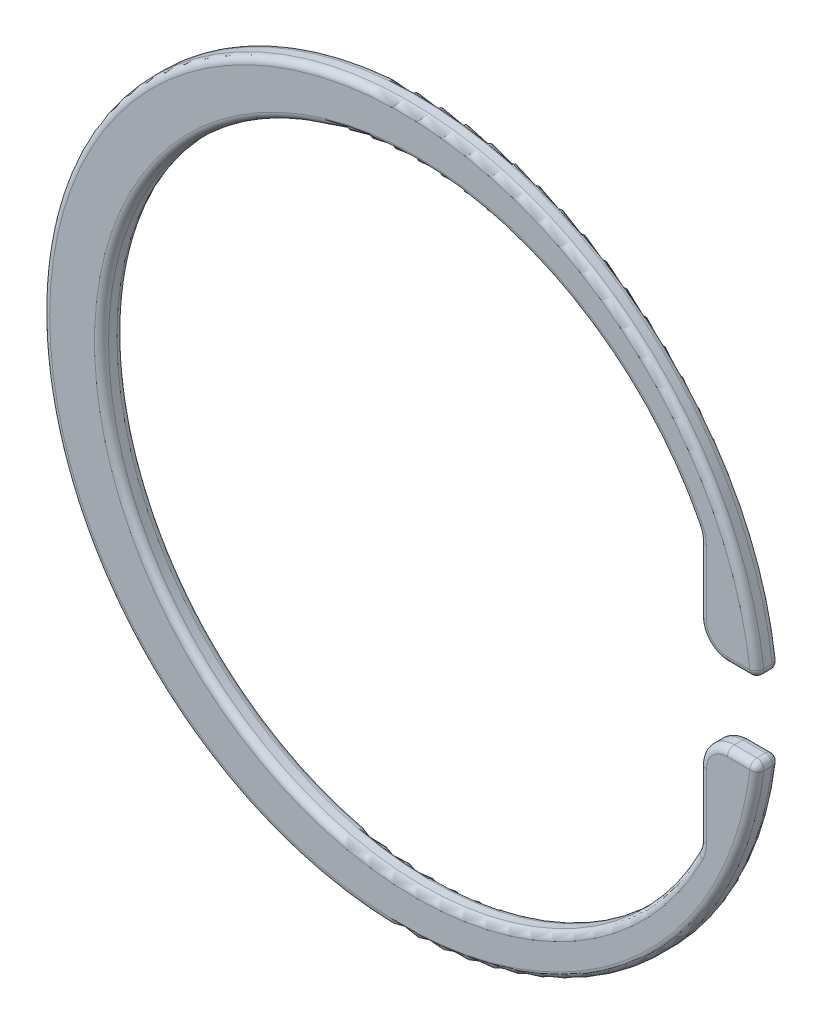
ISO-10303-21;
HEADER;
FILE_DESCRIPTION(('STEP AP214'),'2;1');
FILE_NAME('part.step','',(''),(''),'','','');
FILE_SCHEMA(('AUTOMOTIVE_DESIGN { 1 0 10303 214 1 1 1 1 }'));
ENDSEC;
DATA;
#1=APPLICATION_CONTEXT('core data for automotive mechanical design processes');
#2=APPLICATION_PROTOCOL_DEFINITION('international standard','automotive_design',2000,#1);
#3=PRODUCT_CONTEXT('',#1,'mechanical');
#4=PRODUCT('Part','Part','',(#3));
#5=PRODUCT_RELATED_PRODUCT_CATEGORY('part','',(#4));
#6=PRODUCT_DEFINITION_FORMATION('','',#4);
#7=PRODUCT_DEFINITION_CONTEXT('part definition',#1,'design');
#8=PRODUCT_DEFINITION('design','',#6,#7);
#9=PRODUCT_DEFINITION_SHAPE('','',#8);
#10=(LENGTH_UNIT() NAMED_UNIT(*) SI_UNIT(.MILLI.,.METRE.));
#11=(NAMED_UNIT(*) PLANE_ANGLE_UNIT() SI_UNIT($,.RADIAN.));
#12=(NAMED_UNIT(*) SI_UNIT($,.STERADIAN.) SOLID_ANGLE_UNIT());
#13=UNCERTAINTY_MEASURE_WITH_UNIT(LENGTH_MEASURE(1.E-05),#10,'distance_accuracy_value','');
#14=(GEOMETRIC_REPRESENTATION_CONTEXT(3) GLOBAL_UNCERTAINTY_ASSIGNED_CONTEXT((#13)) GLOBAL_UNIT_ASSIGNED_CONTEXT((#10,
#11,#12)) REPRESENTATION_CONTEXT('',''));
#15=CARTESIAN_POINT('',(0.,0.,0.));
#16=DIRECTION('',(0.,0.,1.));
#17=DIRECTION('',(1.,0.,0.));
#18=AXIS2_PLACEMENT_3D('',#15,#16,#17);
#19=CARTESIAN_POINT('',(4.9022,-2.34369201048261,0.4064));
#20=DIRECTION('',(0.,0.,-1.));
#21=DIRECTION('',(-1.,0.,0.));
#22=AXIS2_PLACEMENT_3D('',#19,#20,#21);
#23=CYLINDRICAL_SURFACE('',#22,0.508000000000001);
#24=DIRECTION('',(0.,0.,-1.));
#25=VECTOR('',#24,1.);
#26=CARTESIAN_POINT('',(5.41020000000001,-2.34369201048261,0.4064));
#27=LINE('',#26,#25);
#28=CARTESIAN_POINT('',(5.41020000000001,-2.34369201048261,0.2794));
#29=VERTEX_POINT('',#28);
#30=CARTESIAN_POINT('',(5.41020000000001,-2.34369201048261,0.127));
#31=VERTEX_POINT('',#30);
#32=EDGE_CURVE('E376',#29,#31,#27,.T.);
#33=ORIENTED_EDGE('',*,*,#32,.T.);
#34=CARTESIAN_POINT('',(4.9022,-2.34369201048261,0.127));
#35=DIRECTION('',(0.,0.,1.));
#36=DIRECTION('',(1.,0.,0.));
#37=AXIS2_PLACEMENT_3D('',#34,#35,#36);
#38=CIRCLE('',#37,0.508000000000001);
#39=CARTESIAN_POINT('',(5.35554963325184,-2.57290394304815,0.127));
#40=VERTEX_POINT('',#39);
#41=EDGE_CURVE('E270',#31,#40,#38,.F.);
#42=ORIENTED_EDGE('',*,*,#41,.T.);
#43=DIRECTION('',(0.,0.,-1.));
#44=VECTOR('',#43,1.);
#45=CARTESIAN_POINT('',(5.35554963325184,-2.57290394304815,0.4064));
#46=LINE('',#45,#44);
#47=CARTESIAN_POINT('',(5.35554963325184,-2.57290394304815,0.2794));
#48=VERTEX_POINT('',#47);
#49=EDGE_CURVE('E396',#48,#40,#46,.T.);
#50=ORIENTED_EDGE('',*,*,#49,.F.);
#51=CARTESIAN_POINT('',(4.9022,-2.34369201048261,0.2794));
#52=DIRECTION('',(0.,0.,1.));
#53=DIRECTION('',(1.,0.,0.));
#54=AXIS2_PLACEMENT_3D('',#51,#52,#53);
#55=CIRCLE('',#54,0.508000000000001);
#56=EDGE_CURVE('E268',#48,#29,#55,.T.);
#57=ORIENTED_EDGE('',*,*,#56,.T.);
#58=EDGE_LOOP('',(#33,#42,#50,#57));
#59=FACE_BOUND('',#58,.T.);
#60=ADVANCED_FACE('F35',(#59),#23,.F.);
#61=CARTESIAN_POINT('',(0.2667,0.,0.4064));
#62=DIRECTION('',(0.,0.,-1.));
#63=DIRECTION('',(-1.,0.,0.));
#64=AXIS2_PLACEMENT_3D('',#61,#62,#63);
#65=CYLINDRICAL_SURFACE('',#64,5.7023);
#66=ORIENTED_EDGE('',*,*,#49,.T.);
#67=CARTESIAN_POINT('',(0.2667,0.,0.127));
#68=DIRECTION('',(0.,0.,1.));
#69=DIRECTION('',(1.,0.,0.));
#70=AXIS2_PLACEMENT_3D('',#67,#68,#69);
#71=CIRCLE('',#70,5.7023);
#72=CARTESIAN_POINT('',(5.35554963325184,2.57290394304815,0.127));
#73=VERTEX_POINT('',#72);
#74=EDGE_CURVE('E266',#40,#73,#71,.F.);
#75=ORIENTED_EDGE('',*,*,#74,.T.);
#76=DIRECTION('',(0.,0.,-1.));
#77=VECTOR('',#76,1.);
#78=CARTESIAN_POINT('',(5.35554963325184,2.57290394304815,0.4064));
#79=LINE('',#78,#77);
#80=CARTESIAN_POINT('',(5.35554963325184,2.57290394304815,0.2794));
#81=VERTEX_POINT('',#80);
#82=EDGE_CURVE('E388',#81,#73,#79,.T.);
#83=ORIENTED_EDGE('',*,*,#82,.F.);
#84=CARTESIAN_POINT('',(0.2667,0.,0.2794));
#85=DIRECTION('',(0.,0.,1.));
#86=DIRECTION('',(1.,0.,0.));
#87=AXIS2_PLACEMENT_3D('',#84,#85,#86);
#88=CIRCLE('',#87,5.7023);
#89=EDGE_CURVE('E264',#81,#48,#88,.T.);
#90=ORIENTED_EDGE('',*,*,#89,.T.);
#91=EDGE_LOOP('',(#66,#75,#83,#90));
#92=FACE_BOUND('',#91,.T.);
#93=ADVANCED_FACE('F499',(#92),#65,.F.);
#94=CARTESIAN_POINT('',(4.9022,2.34369201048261,0.4064));
#95=DIRECTION('',(0.,0.,-1.));
#96=DIRECTION('',(-1.,0.,0.));
#97=AXIS2_PLACEMENT_3D('',#94,#95,#96);
#98=CYLINDRICAL_SURFACE('',#97,0.508000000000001);
#99=ORIENTED_EDGE('',*,*,#82,.T.);
#100=CARTESIAN_POINT('',(4.9022,2.34369201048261,0.127));
#101=DIRECTION('',(0.,0.,1.));
#102=DIRECTION('',(1.,0.,0.));
#103=AXIS2_PLACEMENT_3D('',#100,#101,#102);
#104=CIRCLE('',#103,0.508000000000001);
#105=CARTESIAN_POINT('',(5.4102,2.34369201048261,0.127));
#106=VERTEX_POINT('',#105);
#107=EDGE_CURVE('E262',#73,#106,#104,.F.);
#108=ORIENTED_EDGE('',*,*,#107,.T.);
#109=DIRECTION('',(0.,0.,-1.));
#110=VECTOR('',#109,1.);
#111=CARTESIAN_POINT('',(5.4102,2.34369201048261,0.4064));
#112=LINE('',#111,#110);
#113=CARTESIAN_POINT('',(5.4102,2.34369201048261,0.2794));
#114=VERTEX_POINT('',#113);
#115=EDGE_CURVE('E382',#114,#106,#112,.T.);
#116=ORIENTED_EDGE('',*,*,#115,.F.);
#117=CARTESIAN_POINT('',(4.9022,2.34369201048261,0.2794));
#118=DIRECTION('',(0.,0.,1.));
#119=DIRECTION('',(1.,0.,0.));
#120=AXIS2_PLACEMENT_3D('',#117,#118,#119);
#121=CIRCLE('',#120,0.508000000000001);
#122=EDGE_CURVE('E260',#114,#81,#121,.T.);
#123=ORIENTED_EDGE('',*,*,#122,.T.);
#124=EDGE_LOOP('',(#99,#108,#116,#123));
#125=FACE_BOUND('',#124,.T.);
#126=ADVANCED_FACE('F495',(#125),#98,.F.);
#127=CARTESIAN_POINT('',(5.4102,0.6604,0.4064));
#128=DIRECTION('',(-1.,0.,0.));
#129=DIRECTION('',(0.,0.,1.));
#130=AXIS2_PLACEMENT_3D('',#127,#128,#129);
#131=PLANE('',#130);
#132=ORIENTED_EDGE('',*,*,#115,.T.);
#133=DIRECTION('',(0.,1.,0.));
#134=VECTOR('',#133,1.);
#135=CARTESIAN_POINT('',(5.4102,1.1684,0.127));
#136=LINE('',#135,#134);
#137=CARTESIAN_POINT('',(5.4102,1.1684,0.127));
#138=VERTEX_POINT('',#137);
#139=EDGE_CURVE('E258',#106,#138,#136,.F.);
#140=ORIENTED_EDGE('',*,*,#139,.T.);
#141=DIRECTION('',(0.,0.,-1.));
#142=VECTOR('',#141,1.);
#143=CARTESIAN_POINT('',(5.4102,1.1684,0.4064));
#144=LINE('',#143,#142);
#145=CARTESIAN_POINT('',(5.4102,1.1684,0.2794));
#146=VERTEX_POINT('',#145);
#147=EDGE_CURVE('E395',#138,#146,#144,.F.);
#148=ORIENTED_EDGE('',*,*,#147,.T.);
#149=DIRECTION('',(0.,1.,0.));
#150=VECTOR('',#149,1.);
#151=CARTESIAN_POINT('',(5.4102,0.6604,0.2794));
#152=LINE('',#151,#150);
#153=EDGE_CURVE('E256',#146,#114,#152,.T.);
#154=ORIENTED_EDGE('',*,*,#153,.T.);
#155=EDGE_LOOP('',(#132,#140,#148,#154));
#156=FACE_BOUND('',#155,.T.);
#157=ADVANCED_FACE('F482',(#156),#131,.T.);
#158=CARTESIAN_POINT('',(6.46877713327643,0.6604,0.4064));
#159=DIRECTION('',(0.,-1.,0.));
#160=DIRECTION('',(0.,0.,-1.));
#161=AXIS2_PLACEMENT_3D('',#158,#159,#160);
#162=PLANE('',#161);
#163=DIRECTION('',(0.,0.,-1.));
#164=VECTOR('',#163,1.);
#165=CARTESIAN_POINT('',(5.9182,0.6604,0.4064));
#166=LINE('',#165,#164);
#167=CARTESIAN_POINT('',(5.9182,0.6604,0.2794));
#168=VERTEX_POINT('',#167);
#169=CARTESIAN_POINT('',(5.9182,0.6604,0.127));
#170=VERTEX_POINT('',#169);
#171=EDGE_CURVE('E392',#168,#170,#166,.T.);
#172=ORIENTED_EDGE('',*,*,#171,.T.);
#173=DIRECTION('',(-1.,0.,0.));
#174=VECTOR('',#173,1.);
#175=CARTESIAN_POINT('',(6.46877713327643,0.6604,0.127));
#176=LINE('',#175,#174);
#177=CARTESIAN_POINT('',(6.32658884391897,0.6604,0.127));
#178=VERTEX_POINT('',#177);
#179=EDGE_CURVE('E249',#170,#178,#176,.F.);
#180=ORIENTED_EDGE('',*,*,#179,.T.);
#181=DIRECTION('',(0.,0.,-1.));
#182=VECTOR('',#181,1.);
#183=CARTESIAN_POINT('',(6.32658884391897,0.6604,0.4064));
#184=LINE('',#183,#182);
#185=CARTESIAN_POINT('',(6.32658884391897,0.6604,0.2794));
#186=VERTEX_POINT('',#185);
#187=EDGE_CURVE('E247',#178,#186,#184,.F.);
#188=ORIENTED_EDGE('',*,*,#187,.T.);
#189=DIRECTION('',(-1.,0.,0.));
#190=VECTOR('',#189,1.);
#191=CARTESIAN_POINT('',(6.46877713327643,0.6604,0.2794));
#192=LINE('',#191,#190);
#193=EDGE_CURVE('E245',#186,#168,#192,.T.);
#194=ORIENTED_EDGE('',*,*,#193,.T.);
#195=EDGE_LOOP('',(#172,#180,#188,#194));
#196=FACE_BOUND('',#195,.T.);
#197=ADVANCED_FACE('F462',(#196),#162,.T.);
#198=CARTESIAN_POINT('',(0.,0.,0.4064));
#199=DIRECTION('',(0.,0.,-1.));
#200=DIRECTION('',(-1.,0.,0.));
#201=AXIS2_PLACEMENT_3D('',#198,#199,#200);
#202=CYLINDRICAL_SURFACE('',#201,6.5024);
#203=DIRECTION('',(0.,0.,-1.));
#204=VECTOR('',#203,1.);
#205=CARTESIAN_POINT('',(6.4526165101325,0.803085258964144,0.4064));
#206=LINE('',#205,#204);
#207=CARTESIAN_POINT('',(6.4526165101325,0.803085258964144,0.2794));
#208=VERTEX_POINT('',#207);
#209=CARTESIAN_POINT('',(6.4526165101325,0.803085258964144,0.127));
#210=VERTEX_POINT('',#209);
#211=EDGE_CURVE('E287',#208,#210,#206,.T.);
#212=ORIENTED_EDGE('',*,*,#211,.T.);
#213=CARTESIAN_POINT('',(0.,0.,0.127));
#214=DIRECTION('',(0.,0.,1.));
#215=DIRECTION('',(1.,0.,0.));
#216=AXIS2_PLACEMENT_3D('',#213,#214,#215);
#217=CIRCLE('',#216,6.5024);
#218=CARTESIAN_POINT('',(6.4526165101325,-0.803085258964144,0.127));
#219=VERTEX_POINT('',#218);
#220=EDGE_CURVE('E291',#210,#219,#217,.T.);
#221=ORIENTED_EDGE('',*,*,#220,.T.);
#222=DIRECTION('',(0.,0.,-1.));
#223=VECTOR('',#222,1.);
#224=CARTESIAN_POINT('',(6.4526165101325,-0.803085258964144,0.4064));
#225=LINE('',#224,#223);
#226=CARTESIAN_POINT('',(6.4526165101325,-0.803085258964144,0.2794));
#227=VERTEX_POINT('',#226);
#228=EDGE_CURVE('E289',#219,#227,#225,.F.);
#229=ORIENTED_EDGE('',*,*,#228,.T.);
#230=CARTESIAN_POINT('',(0.,0.,0.2794));
#231=DIRECTION('',(0.,0.,1.));
#232=DIRECTION('',(1.,0.,0.));
#233=AXIS2_PLACEMENT_3D('',#230,#231,#232);
#234=CIRCLE('',#233,6.5024);
#235=EDGE_CURVE('E285',#227,#208,#234,.F.);
#236=ORIENTED_EDGE('',*,*,#235,.T.);
#237=EDGE_LOOP('',(#212,#221,#229,#236));
#238=FACE_BOUND('',#237,.T.);
#239=ADVANCED_FACE('F432',(#238),#202,.T.);
#240=CARTESIAN_POINT('',(5.4102,-0.6604,0.4064));
#241=DIRECTION('',(0.,1.,0.));
#242=DIRECTION('',(0.,0.,1.));
#243=AXIS2_PLACEMENT_3D('',#240,#241,#242);
#244=PLANE('',#243);
#245=DIRECTION('',(0.,0.,-1.));
#246=VECTOR('',#245,1.);
#247=CARTESIAN_POINT('',(6.32658884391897,-0.6604,0.4064));
#248=LINE('',#247,#246);
#249=CARTESIAN_POINT('',(6.32658884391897,-0.6604,0.2794));
#250=VERTEX_POINT('',#249);
#251=CARTESIAN_POINT('',(6.32658884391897,-0.6604,0.127));
#252=VERTEX_POINT('',#251);
#253=EDGE_CURVE('E274',#250,#252,#248,.T.);
#254=ORIENTED_EDGE('',*,*,#253,.T.);
#255=DIRECTION('',(1.,0.,0.));
#256=VECTOR('',#255,1.);
#257=CARTESIAN_POINT('',(5.9182,-0.6604,0.127));
#258=LINE('',#257,#256);
#259=CARTESIAN_POINT('',(5.9182,-0.6604,0.127));
#260=VERTEX_POINT('',#259);
#261=EDGE_CURVE('E205',#252,#260,#258,.F.);
#262=ORIENTED_EDGE('',*,*,#261,.T.);
#263=DIRECTION('',(0.,0.,-1.));
#264=VECTOR('',#263,1.);
#265=CARTESIAN_POINT('',(5.9182,-0.6604,0.4064));
#266=LINE('',#265,#264);
#267=CARTESIAN_POINT('',(5.9182,-0.6604,0.2794));
#268=VERTEX_POINT('',#267);
#269=EDGE_CURVE('E224',#260,#268,#266,.F.);
#270=ORIENTED_EDGE('',*,*,#269,.T.);
#271=DIRECTION('',(1.,0.,0.));
#272=VECTOR('',#271,1.);
#273=CARTESIAN_POINT('',(5.4102,-0.6604,0.2794));
#274=LINE('',#273,#272);
#275=EDGE_CURVE('E272',#268,#250,#274,.T.);
#276=ORIENTED_EDGE('',*,*,#275,.T.);
#277=EDGE_LOOP('',(#254,#262,#270,#276));
#278=FACE_BOUND('',#277,.T.);
#279=ADVANCED_FACE('F418',(#278),#244,.T.);
#280=CARTESIAN_POINT('',(5.41020000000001,-2.34369201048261,0.4064));
#281=DIRECTION('',(-1.,0.,0.));
#282=DIRECTION('',(0.,-1.,0.));
#283=AXIS2_PLACEMENT_3D('',#280,#281,#282);
#284=PLANE('',#283);
#285=DIRECTION('',(0.,0.,-1.));
#286=VECTOR('',#285,1.);
#287=CARTESIAN_POINT('',(5.4102,-1.1684,0.4064));
#288=LINE('',#287,#286);
#289=CARTESIAN_POINT('',(5.4102,-1.1684,0.2794));
#290=VERTEX_POINT('',#289);
#291=CARTESIAN_POINT('',(5.4102,-1.1684,0.127));
#292=VERTEX_POINT('',#291);
#293=EDGE_CURVE('E227',#290,#292,#288,.T.);
#294=ORIENTED_EDGE('',*,*,#293,.T.);
#295=DIRECTION('',(0.,1.,0.));
#296=VECTOR('',#295,1.);
#297=CARTESIAN_POINT('',(5.41020000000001,-2.34369201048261,0.127));
#298=LINE('',#297,#296);
#299=EDGE_CURVE('E279',#292,#31,#298,.F.);
#300=ORIENTED_EDGE('',*,*,#299,.T.);
#301=ORIENTED_EDGE('',*,*,#32,.F.);
#302=DIRECTION('',(0.,1.,0.));
#303=VECTOR('',#302,1.);
#304=CARTESIAN_POINT('',(5.41020000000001,-2.34369201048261,0.2794));
#305=LINE('',#304,#303);
#306=EDGE_CURVE('E277',#29,#290,#305,.T.);
#307=ORIENTED_EDGE('',*,*,#306,.T.);
#308=EDGE_LOOP('',(#294,#300,#301,#307));
#309=FACE_BOUND('',#308,.T.);
#310=ADVANCED_FACE('F402',(#309),#284,.T.);
#311=CARTESIAN_POINT('',(4.9022,-2.34369201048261,0.4064));
#312=DIRECTION('',(0.,0.,1.));
#313=DIRECTION('',(1.,0.,0.));
#314=AXIS2_PLACEMENT_3D('',#311,#312,#313);
#315=PLANE('',#314);
#316=DIRECTION('',(-1.,0.,0.));
#317=VECTOR('',#316,1.);
#318=CARTESIAN_POINT('',(4.9022,0.7874,0.4064));
#319=LINE('',#318,#317);
#320=CARTESIAN_POINT('',(5.9182,0.7874,0.4064));
#321=VERTEX_POINT('',#320);
#322=CARTESIAN_POINT('',(6.32658884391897,0.7874,0.4064));
#323=VERTEX_POINT('',#322);
#324=EDGE_CURVE('E300',#321,#323,#319,.F.);
#325=ORIENTED_EDGE('',*,*,#324,.T.);
#326=CARTESIAN_POINT('',(0.,0.,0.4064));
#327=DIRECTION('',(0.,0.,1.));
#328=DIRECTION('',(1.,0.,0.));
#329=AXIS2_PLACEMENT_3D('',#326,#327,#328);
#330=CIRCLE('',#329,6.3754);
#331=CARTESIAN_POINT('',(6.32658884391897,-0.7874,0.4064));
#332=VERTEX_POINT('',#331);
#333=EDGE_CURVE('E11',#323,#332,#330,.T.);
#334=ORIENTED_EDGE('',*,*,#333,.T.);
#335=DIRECTION('',(1.,0.,0.));
#336=VECTOR('',#335,1.);
#337=CARTESIAN_POINT('',(4.9022,-0.7874,0.4064));
#338=LINE('',#337,#336);
#339=CARTESIAN_POINT('',(5.9182,-0.7874,0.4064));
#340=VERTEX_POINT('',#339);
#341=EDGE_CURVE('E44',#332,#340,#338,.F.);
#342=ORIENTED_EDGE('',*,*,#341,.T.);
#343=CARTESIAN_POINT('',(5.9182,-1.1684,0.4064));
#344=DIRECTION('',(0.,0.,1.));
#345=DIRECTION('',(1.,0.,0.));
#346=AXIS2_PLACEMENT_3D('',#343,#344,#345);
#347=CIRCLE('',#346,0.381);
#348=CARTESIAN_POINT('',(5.5372,-1.1684,0.4064));
#349=VERTEX_POINT('',#348);
#350=EDGE_CURVE('E308',#340,#349,#347,.T.);
#351=ORIENTED_EDGE('',*,*,#350,.T.);
#352=DIRECTION('',(0.,1.,0.));
#353=VECTOR('',#352,1.);
#354=CARTESIAN_POINT('',(5.5372,-2.34369201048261,0.4064));
#355=LINE('',#354,#353);
#356=CARTESIAN_POINT('',(5.5372,-2.34369201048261,0.4064));
#357=VERTEX_POINT('',#356);
#358=EDGE_CURVE('E306',#349,#357,#355,.F.);
#359=ORIENTED_EDGE('',*,*,#358,.T.);
#360=CARTESIAN_POINT('',(4.9022,-2.34369201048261,0.4064));
#361=DIRECTION('',(0.,0.,1.));
#362=DIRECTION('',(1.,0.,0.));
#363=AXIS2_PLACEMENT_3D('',#360,#361,#362);
#364=CIRCLE('',#363,0.635000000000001);
#365=CARTESIAN_POINT('',(5.46888704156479,-2.63020692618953,0.4064));
#366=VERTEX_POINT('',#365);
#367=EDGE_CURVE('E304',#357,#366,#364,.F.);
#368=ORIENTED_EDGE('',*,*,#367,.T.);
#369=CARTESIAN_POINT('',(0.2667,0.,0.4064));
#370=DIRECTION('',(0.,0.,1.));
#371=DIRECTION('',(1.,0.,0.));
#372=AXIS2_PLACEMENT_3D('',#369,#370,#371);
#373=CIRCLE('',#372,5.8293);
#374=CARTESIAN_POINT('',(5.46888704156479,2.63020692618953,0.4064));
#375=VERTEX_POINT('',#374);
#376=EDGE_CURVE('E302',#366,#375,#373,.F.);
#377=ORIENTED_EDGE('',*,*,#376,.T.);
#378=CARTESIAN_POINT('',(4.9022,2.34369201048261,0.4064));
#379=DIRECTION('',(0.,0.,1.));
#380=DIRECTION('',(1.,0.,0.));
#381=AXIS2_PLACEMENT_3D('',#378,#379,#380);
#382=CIRCLE('',#381,0.635000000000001);
#383=CARTESIAN_POINT('',(5.5372,2.34369201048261,0.4064));
#384=VERTEX_POINT('',#383);
#385=EDGE_CURVE('E298',#375,#384,#382,.F.);
#386=ORIENTED_EDGE('',*,*,#385,.T.);
#387=DIRECTION('',(0.,1.,0.));
#388=VECTOR('',#387,1.);
#389=CARTESIAN_POINT('',(5.5372,-2.34369201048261,0.4064));
#390=LINE('',#389,#388);
#391=CARTESIAN_POINT('',(5.5372,1.1684,0.4064));
#392=VERTEX_POINT('',#391);
#393=EDGE_CURVE('E294',#384,#392,#390,.F.);
#394=ORIENTED_EDGE('',*,*,#393,.T.);
#395=CARTESIAN_POINT('',(5.9182,1.1684,0.4064));
#396=DIRECTION('',(0.,0.,1.));
#397=DIRECTION('',(1.,0.,0.));
#398=AXIS2_PLACEMENT_3D('',#395,#396,#397);
#399=CIRCLE('',#398,0.381);
#400=EDGE_CURVE('E296',#392,#321,#399,.T.);
#401=ORIENTED_EDGE('',*,*,#400,.T.);
#402=EDGE_LOOP('',(#325,#334,#342,#351,#359,#368,#377,#386,#394,#401));
#403=FACE_BOUND('',#402,.T.);
#404=ADVANCED_FACE('F474',(#403),#315,.T.);
#405=CARTESIAN_POINT('',(4.9022,-2.34369201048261,0.));
#406=DIRECTION('',(0.,0.,1.));
#407=DIRECTION('',(1.,0.,0.));
#408=AXIS2_PLACEMENT_3D('',#405,#406,#407);
#409=PLANE('',#408);
#410=DIRECTION('',(-1.,0.,0.));
#411=VECTOR('',#410,1.);
#412=CARTESIAN_POINT('',(5.9182,0.7874,0.));
#413=LINE('',#412,#411);
#414=CARTESIAN_POINT('',(6.32658884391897,0.7874,0.));
#415=VERTEX_POINT('',#414);
#416=CARTESIAN_POINT('',(5.9182,0.7874,0.));
#417=VERTEX_POINT('',#416);
#418=EDGE_CURVE('E198',#415,#417,#413,.T.);
#419=ORIENTED_EDGE('',*,*,#418,.T.);
#420=CARTESIAN_POINT('',(5.9182,1.1684,0.));
#421=DIRECTION('',(0.,0.,1.));
#422=DIRECTION('',(1.,0.,0.));
#423=AXIS2_PLACEMENT_3D('',#420,#421,#422);
#424=CIRCLE('',#423,0.381);
#425=CARTESIAN_POINT('',(5.5372,1.1684,0.));
#426=VERTEX_POINT('',#425);
#427=EDGE_CURVE('E243',#417,#426,#424,.F.);
#428=ORIENTED_EDGE('',*,*,#427,.T.);
#429=DIRECTION('',(0.,1.,0.));
#430=VECTOR('',#429,1.);
#431=CARTESIAN_POINT('',(5.5372,2.34369201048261,0.));
#432=LINE('',#431,#430);
#433=CARTESIAN_POINT('',(5.5372,2.34369201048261,0.));
#434=VERTEX_POINT('',#433);
#435=EDGE_CURVE('E241',#426,#434,#432,.T.);
#436=ORIENTED_EDGE('',*,*,#435,.T.);
#437=CARTESIAN_POINT('',(4.9022,2.34369201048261,0.));
#438=DIRECTION('',(0.,0.,1.));
#439=DIRECTION('',(1.,0.,0.));
#440=AXIS2_PLACEMENT_3D('',#437,#438,#439);
#441=CIRCLE('',#440,0.635000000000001);
#442=CARTESIAN_POINT('',(5.46888704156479,2.63020692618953,0.));
#443=VERTEX_POINT('',#442);
#444=EDGE_CURVE('E239',#434,#443,#441,.T.);
#445=ORIENTED_EDGE('',*,*,#444,.T.);
#446=CARTESIAN_POINT('',(0.2667,0.,0.));
#447=DIRECTION('',(0.,0.,1.));
#448=DIRECTION('',(1.,0.,0.));
#449=AXIS2_PLACEMENT_3D('',#446,#447,#448);
#450=CIRCLE('',#449,5.8293);
#451=CARTESIAN_POINT('',(5.46888704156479,-2.63020692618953,0.));
#452=VERTEX_POINT('',#451);
#453=EDGE_CURVE('E237',#443,#452,#450,.T.);
#454=ORIENTED_EDGE('',*,*,#453,.T.);
#455=CARTESIAN_POINT('',(4.9022,-2.34369201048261,0.));
#456=DIRECTION('',(0.,0.,1.));
#457=DIRECTION('',(1.,0.,0.));
#458=AXIS2_PLACEMENT_3D('',#455,#456,#457);
#459=CIRCLE('',#458,0.635000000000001);
#460=CARTESIAN_POINT('',(5.5372,-2.34369201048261,0.));
#461=VERTEX_POINT('',#460);
#462=EDGE_CURVE('E235',#452,#461,#459,.T.);
#463=ORIENTED_EDGE('',*,*,#462,.T.);
#464=DIRECTION('',(0.,1.,0.));
#465=VECTOR('',#464,1.);
#466=CARTESIAN_POINT('',(5.5372,-1.1684,0.));
#467=LINE('',#466,#465);
#468=CARTESIAN_POINT('',(5.5372,-1.1684,0.));
#469=VERTEX_POINT('',#468);
#470=EDGE_CURVE('E233',#461,#469,#467,.T.);
#471=ORIENTED_EDGE('',*,*,#470,.T.);
#472=CARTESIAN_POINT('',(5.9182,-1.1684,0.));
#473=DIRECTION('',(0.,0.,1.));
#474=DIRECTION('',(1.,0.,0.));
#475=AXIS2_PLACEMENT_3D('',#472,#473,#474);
#476=CIRCLE('',#475,0.381);
#477=CARTESIAN_POINT('',(5.9182,-0.7874,0.));
#478=VERTEX_POINT('',#477);
#479=EDGE_CURVE('E194',#469,#478,#476,.F.);
#480=ORIENTED_EDGE('',*,*,#479,.T.);
#481=DIRECTION('',(1.,0.,0.));
#482=VECTOR('',#481,1.);
#483=CARTESIAN_POINT('',(6.46877713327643,-0.7874,0.));
#484=LINE('',#483,#482);
#485=CARTESIAN_POINT('',(6.32658884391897,-0.7874,0.));
#486=VERTEX_POINT('',#485);
#487=EDGE_CURVE('E186',#478,#486,#484,.T.);
#488=ORIENTED_EDGE('',*,*,#487,.T.);
#489=CARTESIAN_POINT('',(0.,0.,0.));
#490=DIRECTION('',(0.,0.,1.));
#491=DIRECTION('',(1.,0.,0.));
#492=AXIS2_PLACEMENT_3D('',#489,#490,#491);
#493=CIRCLE('',#492,6.3754);
#494=EDGE_CURVE('E191',#486,#415,#493,.F.);
#495=ORIENTED_EDGE('',*,*,#494,.T.);
#496=EDGE_LOOP('',(#419,#428,#436,#445,#454,#463,#471,#480,#488,#495));
#497=FACE_BOUND('',#496,.T.);
#498=ADVANCED_FACE('F189',(#497),#409,.F.);
#499=CARTESIAN_POINT('',(5.9182,1.1684,0.4064));
#500=DIRECTION('',(0.,0.,-1.));
#501=DIRECTION('',(-1.,0.,0.));
#502=AXIS2_PLACEMENT_3D('',#499,#500,#501);
#503=CYLINDRICAL_SURFACE('',#502,0.508);
#504=ORIENTED_EDGE('',*,*,#147,.F.);
#505=CARTESIAN_POINT('',(5.9182,1.1684,0.127));
#506=DIRECTION('',(0.,0.,1.));
#507=DIRECTION('',(1.,0.,0.));
#508=AXIS2_PLACEMENT_3D('',#505,#506,#507);
#509=CIRCLE('',#508,0.508);
#510=EDGE_CURVE('E254',#138,#170,#509,.T.);
#511=ORIENTED_EDGE('',*,*,#510,.T.);
#512=ORIENTED_EDGE('',*,*,#171,.F.);
#513=CARTESIAN_POINT('',(5.9182,1.1684,0.2794));
#514=DIRECTION('',(0.,0.,1.));
#515=DIRECTION('',(1.,0.,0.));
#516=AXIS2_PLACEMENT_3D('',#513,#514,#515);
#517=CIRCLE('',#516,0.508);
#518=EDGE_CURVE('E252',#168,#146,#517,.F.);
#519=ORIENTED_EDGE('',*,*,#518,.T.);
#520=EDGE_LOOP('',(#504,#511,#512,#519));
#521=FACE_BOUND('',#520,.T.);
#522=ADVANCED_FACE('F459',(#521),#503,.T.);
#523=CARTESIAN_POINT('',(5.9182,-1.1684,0.4064));
#524=DIRECTION('',(0.,0.,-1.));
#525=DIRECTION('',(-1.,0.,0.));
#526=AXIS2_PLACEMENT_3D('',#523,#524,#525);
#527=CYLINDRICAL_SURFACE('',#526,0.508);
#528=ORIENTED_EDGE('',*,*,#269,.F.);
#529=CARTESIAN_POINT('',(5.9182,-1.1684,0.127));
#530=DIRECTION('',(0.,0.,1.));
#531=DIRECTION('',(1.,0.,0.));
#532=AXIS2_PLACEMENT_3D('',#529,#530,#531);
#533=CIRCLE('',#532,0.508);
#534=EDGE_CURVE('E283',#260,#292,#533,.T.);
#535=ORIENTED_EDGE('',*,*,#534,.T.);
#536=ORIENTED_EDGE('',*,*,#293,.F.);
#537=CARTESIAN_POINT('',(5.9182,-1.1684,0.2794));
#538=DIRECTION('',(0.,0.,1.));
#539=DIRECTION('',(1.,0.,0.));
#540=AXIS2_PLACEMENT_3D('',#537,#538,#539);
#541=CIRCLE('',#540,0.508);
#542=EDGE_CURVE('E281',#290,#268,#541,.F.);
#543=ORIENTED_EDGE('',*,*,#542,.T.);
#544=EDGE_LOOP('',(#528,#535,#536,#543));
#545=FACE_BOUND('',#544,.T.);
#546=ADVANCED_FACE('F414',(#545),#527,.T.);
#547=CARTESIAN_POINT('',(4.9022,-2.34369201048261,0.2794));
#548=DIRECTION('',(0.,0.,1.));
#549=DIRECTION('',(1.,0.,0.));
#550=AXIS2_PLACEMENT_3D('',#547,#548,#549);
#551=TOROIDAL_SURFACE('',#550,0.635000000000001,0.127);
#552=CARTESIAN_POINT('',(5.5372,-2.34369201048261,0.2794));
#553=DIRECTION('',(0.,1.,0.));
#554=DIRECTION('',(0.,0.,1.));
#555=AXIS2_PLACEMENT_3D('',#552,#553,#554);
#556=CIRCLE('',#555,0.127);
#557=EDGE_CURVE('E369',#29,#357,#556,.T.);
#558=ORIENTED_EDGE('',*,*,#557,.F.);
#559=ORIENTED_EDGE('',*,*,#56,.F.);
#560=CARTESIAN_POINT('',(5.46888704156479,-2.63020692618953,0.2794));
#561=DIRECTION('',(-0.451204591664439,-0.892420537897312,0.));
#562=DIRECTION('',(0.892420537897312,-0.451204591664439,0.));
#563=AXIS2_PLACEMENT_3D('',#560,#561,#562);
#564=CIRCLE('',#563,0.127);
#565=EDGE_CURVE('E39',#366,#48,#564,.T.);
#566=ORIENTED_EDGE('',*,*,#565,.F.);
#567=ORIENTED_EDGE('',*,*,#367,.F.);
#568=EDGE_LOOP('',(#558,#559,#566,#567));
#569=FACE_BOUND('',#568,.T.);
#570=ADVANCED_FACE('F37',(#569),#551,.T.);
#571=CARTESIAN_POINT('',(0.2667,0.,0.2794));
#572=DIRECTION('',(0.,0.,1.));
#573=DIRECTION('',(1.,0.,0.));
#574=AXIS2_PLACEMENT_3D('',#571,#572,#573);
#575=TOROIDAL_SURFACE('',#574,5.8293,0.127);
#576=ORIENTED_EDGE('',*,*,#565,.T.);
#577=ORIENTED_EDGE('',*,*,#89,.F.);
#578=CARTESIAN_POINT('',(5.46888704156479,2.63020692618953,0.2794));
#579=DIRECTION('',(0.451204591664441,-0.89242053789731,0.));
#580=DIRECTION('',(0.89242053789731,0.451204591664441,0.));
#581=AXIS2_PLACEMENT_3D('',#578,#579,#580);
#582=CIRCLE('',#581,0.127);
#583=EDGE_CURVE('E367',#375,#81,#582,.T.);
#584=ORIENTED_EDGE('',*,*,#583,.F.);
#585=ORIENTED_EDGE('',*,*,#376,.F.);
#586=EDGE_LOOP('',(#576,#577,#584,#585));
#587=FACE_BOUND('',#586,.T.);
#588=ADVANCED_FACE('F502',(#587),#575,.T.);
#589=CARTESIAN_POINT('',(5.5372,-2.34369201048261,0.2794));
#590=DIRECTION('',(0.,1.,0.));
#591=DIRECTION('',(-1.,0.,0.));
#592=AXIS2_PLACEMENT_3D('',#589,#590,#591);
#593=CYLINDRICAL_SURFACE('',#592,0.127);
#594=ORIENTED_EDGE('',*,*,#557,.T.);
#595=ORIENTED_EDGE('',*,*,#358,.F.);
#596=CARTESIAN_POINT('',(5.5372,-1.1684,0.2794));
#597=DIRECTION('',(0.,1.,0.));
#598=DIRECTION('',(-1.,0.,0.));
#599=AXIS2_PLACEMENT_3D('',#596,#597,#598);
#600=CIRCLE('',#599,0.127);
#601=EDGE_CURVE('E364',#290,#349,#600,.T.);
#602=ORIENTED_EDGE('',*,*,#601,.F.);
#603=ORIENTED_EDGE('',*,*,#306,.F.);
#604=EDGE_LOOP('',(#594,#595,#602,#603));
#605=FACE_BOUND('',#604,.T.);
#606=ADVANCED_FACE('F696',(#605),#593,.T.);
#607=CARTESIAN_POINT('',(4.9022,2.34369201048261,0.2794));
#608=DIRECTION('',(0.,0.,1.));
#609=DIRECTION('',(1.,0.,0.));
#610=AXIS2_PLACEMENT_3D('',#607,#608,#609);
#611=TOROIDAL_SURFACE('',#610,0.635000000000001,0.127);
#612=ORIENTED_EDGE('',*,*,#583,.T.);
#613=ORIENTED_EDGE('',*,*,#122,.F.);
#614=CARTESIAN_POINT('',(5.5372,2.34369201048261,0.2794));
#615=DIRECTION('',(0.,-1.,0.));
#616=DIRECTION('',(0.,0.,-1.));
#617=AXIS2_PLACEMENT_3D('',#614,#615,#616);
#618=CIRCLE('',#617,0.127);
#619=EDGE_CURVE('E361',#384,#114,#618,.T.);
#620=ORIENTED_EDGE('',*,*,#619,.F.);
#621=ORIENTED_EDGE('',*,*,#385,.F.);
#622=EDGE_LOOP('',(#612,#613,#620,#621));
#623=FACE_BOUND('',#622,.T.);
#624=ADVANCED_FACE('F490',(#623),#611,.T.);
#625=CARTESIAN_POINT('',(5.9182,-1.1684,0.2794));
#626=DIRECTION('',(0.,0.,1.));
#627=DIRECTION('',(1.,0.,0.));
#628=AXIS2_PLACEMENT_3D('',#625,#626,#627);
#629=TOROIDAL_SURFACE('',#628,0.381,0.127);
#630=ORIENTED_EDGE('',*,*,#601,.T.);
#631=ORIENTED_EDGE('',*,*,#350,.F.);
#632=CARTESIAN_POINT('',(5.9182,-0.7874,0.2794));
#633=DIRECTION('',(1.,0.,0.));
#634=DIRECTION('',(0.,0.,-1.));
#635=AXIS2_PLACEMENT_3D('',#632,#633,#634);
#636=CIRCLE('',#635,0.127);
#637=EDGE_CURVE('E358',#268,#340,#636,.T.);
#638=ORIENTED_EDGE('',*,*,#637,.F.);
#639=ORIENTED_EDGE('',*,*,#542,.F.);
#640=EDGE_LOOP('',(#630,#631,#638,#639));
#641=FACE_BOUND('',#640,.T.);
#642=ADVANCED_FACE('F422',(#641),#629,.T.);
#643=CARTESIAN_POINT('',(5.5372,0.6604,0.2794));
#644=DIRECTION('',(0.,1.,0.));
#645=DIRECTION('',(0.,0.,1.));
#646=AXIS2_PLACEMENT_3D('',#643,#644,#645);
#647=CYLINDRICAL_SURFACE('',#646,0.127);
#648=ORIENTED_EDGE('',*,*,#619,.T.);
#649=ORIENTED_EDGE('',*,*,#153,.F.);
#650=CARTESIAN_POINT('',(5.5372,1.1684,0.2794));
#651=DIRECTION('',(0.,-1.,0.));
#652=DIRECTION('',(0.,0.,-1.));
#653=AXIS2_PLACEMENT_3D('',#650,#651,#652);
#654=CIRCLE('',#653,0.127);
#655=EDGE_CURVE('E355',#392,#146,#654,.T.);
#656=ORIENTED_EDGE('',*,*,#655,.F.);
#657=ORIENTED_EDGE('',*,*,#393,.F.);
#658=EDGE_LOOP('',(#648,#649,#656,#657));
#659=FACE_BOUND('',#658,.T.);
#660=ADVANCED_FACE('F485',(#659),#647,.T.);
#661=CARTESIAN_POINT('',(5.4102,-0.7874,0.2794));
#662=DIRECTION('',(1.,0.,0.));
#663=DIRECTION('',(0.,0.,-1.));
#664=AXIS2_PLACEMENT_3D('',#661,#662,#663);
#665=CYLINDRICAL_SURFACE('',#664,0.127);
#666=ORIENTED_EDGE('',*,*,#637,.T.);
#667=ORIENTED_EDGE('',*,*,#341,.F.);
#668=CARTESIAN_POINT('',(6.32658884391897,-0.7874,0.2794));
#669=DIRECTION('',(1.,0.,0.));
#670=DIRECTION('',(0.,0.,-1.));
#671=AXIS2_PLACEMENT_3D('',#668,#669,#670);
#672=CIRCLE('',#671,0.127);
#673=EDGE_CURVE('E353',#250,#332,#672,.T.);
#674=ORIENTED_EDGE('',*,*,#673,.F.);
#675=ORIENTED_EDGE('',*,*,#275,.F.);
#676=EDGE_LOOP('',(#666,#667,#674,#675));
#677=FACE_BOUND('',#676,.T.);
#678=ADVANCED_FACE('F424',(#677),#665,.T.);
#679=CARTESIAN_POINT('',(5.5372,-2.34369201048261,0.127));
#680=DIRECTION('',(0.,-1.,0.));
#681=DIRECTION('',(1.,0.,0.));
#682=AXIS2_PLACEMENT_3D('',#679,#680,#681);
#683=CYLINDRICAL_SURFACE('',#682,0.127);
#684=CARTESIAN_POINT('',(5.5372,-2.34369201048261,0.127));
#685=DIRECTION('',(0.,-1.,0.));
#686=DIRECTION('',(1.,0.,0.));
#687=AXIS2_PLACEMENT_3D('',#684,#685,#686);
#688=CIRCLE('',#687,0.127);
#689=EDGE_CURVE('E347',#31,#461,#688,.T.);
#690=ORIENTED_EDGE('',*,*,#689,.F.);
#691=ORIENTED_EDGE('',*,*,#299,.F.);
#692=CARTESIAN_POINT('',(5.5372,-1.1684,0.127));
#693=DIRECTION('',(0.,1.,0.));
#694=DIRECTION('',(-1.,0.,0.));
#695=AXIS2_PLACEMENT_3D('',#692,#693,#694);
#696=CIRCLE('',#695,0.127);
#697=EDGE_CURVE('E350',#469,#292,#696,.T.);
#698=ORIENTED_EDGE('',*,*,#697,.F.);
#699=ORIENTED_EDGE('',*,*,#470,.F.);
#700=EDGE_LOOP('',(#690,#691,#698,#699));
#701=FACE_BOUND('',#700,.T.);
#702=ADVANCED_FACE('F407',(#701),#683,.T.);
#703=CARTESIAN_POINT('',(5.9182,1.1684,0.2794));
#704=DIRECTION('',(0.,0.,1.));
#705=DIRECTION('',(1.,0.,0.));
#706=AXIS2_PLACEMENT_3D('',#703,#704,#705);
#707=TOROIDAL_SURFACE('',#706,0.381,0.127);
#708=ORIENTED_EDGE('',*,*,#655,.T.);
#709=ORIENTED_EDGE('',*,*,#518,.F.);
#710=CARTESIAN_POINT('',(5.9182,0.7874,0.2794));
#711=DIRECTION('',(1.,0.,0.));
#712=DIRECTION('',(0.,0.,-1.));
#713=AXIS2_PLACEMENT_3D('',#710,#711,#712);
#714=CIRCLE('',#713,0.127);
#715=EDGE_CURVE('E344',#321,#168,#714,.T.);
#716=ORIENTED_EDGE('',*,*,#715,.F.);
#717=ORIENTED_EDGE('',*,*,#400,.F.);
#718=EDGE_LOOP('',(#708,#709,#716,#717));
#719=FACE_BOUND('',#718,.T.);
#720=ADVANCED_FACE('F479',(#719),#707,.T.);
#721=CARTESIAN_POINT('',(6.32658884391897,-0.7874,0.2794));
#722=DIRECTION('',(0.,0.,1.));
#723=DIRECTION('',(1.,0.,0.));
#724=AXIS2_PLACEMENT_3D('',#721,#722,#723);
#725=SPHERICAL_SURFACE('',#724,0.127);
#726=CARTESIAN_POINT('',(6.32658884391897,-0.7874,0.2794));
#727=DIRECTION('',(0.,0.,1.));
#728=DIRECTION('',(1.,0.,0.));
#729=AXIS2_PLACEMENT_3D('',#726,#727,#728);
#730=CIRCLE('',#729,0.127);
#731=EDGE_CURVE('E340',#250,#227,#730,.F.);
#732=ORIENTED_EDGE('',*,*,#731,.F.);
#733=ORIENTED_EDGE('',*,*,#673,.T.);
#734=CARTESIAN_POINT('',(6.32658884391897,-0.7874,0.2794));
#735=DIRECTION('',(0.123505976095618,0.992343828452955,0.));
#736=DIRECTION('',(-0.992343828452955,0.123505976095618,0.));
#737=AXIS2_PLACEMENT_3D('',#734,#735,#736);
#738=CIRCLE('',#737,0.127);
#739=EDGE_CURVE('E52',#227,#332,#738,.F.);
#740=ORIENTED_EDGE('',*,*,#739,.F.);
#741=EDGE_LOOP('',(#732,#733,#740));
#742=FACE_BOUND('',#741,.T.);
#743=ADVANCED_FACE('F428',(#742),#725,.T.);
#744=CARTESIAN_POINT('',(5.9182,-1.1684,0.127));
#745=DIRECTION('',(0.,0.,1.));
#746=DIRECTION('',(1.,0.,0.));
#747=AXIS2_PLACEMENT_3D('',#744,#745,#746);
#748=TOROIDAL_SURFACE('',#747,0.381,0.127);
#749=ORIENTED_EDGE('',*,*,#697,.T.);
#750=ORIENTED_EDGE('',*,*,#534,.F.);
#751=CARTESIAN_POINT('',(5.9182,-0.7874,0.127));
#752=DIRECTION('',(1.,0.,0.));
#753=DIRECTION('',(0.,0.,-1.));
#754=AXIS2_PLACEMENT_3D('',#751,#752,#753);
#755=CIRCLE('',#754,0.127);
#756=EDGE_CURVE('E338',#478,#260,#755,.T.);
#757=ORIENTED_EDGE('',*,*,#756,.F.);
#758=ORIENTED_EDGE('',*,*,#479,.F.);
#759=EDGE_LOOP('',(#749,#750,#757,#758));
#760=FACE_BOUND('',#759,.T.);
#761=ADVANCED_FACE('F412',(#760),#748,.T.);
#762=CARTESIAN_POINT('',(4.9022,-2.34369201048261,0.127));
#763=DIRECTION('',(0.,0.,1.));
#764=DIRECTION('',(1.,0.,0.));
#765=AXIS2_PLACEMENT_3D('',#762,#763,#764);
#766=TOROIDAL_SURFACE('',#765,0.635000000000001,0.127);
#767=ORIENTED_EDGE('',*,*,#689,.T.);
#768=ORIENTED_EDGE('',*,*,#462,.F.);
#769=CARTESIAN_POINT('',(5.4688870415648,-2.63020692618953,0.127));
#770=DIRECTION('',(-0.451204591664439,-0.892420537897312,0.));
#771=DIRECTION('',(0.892420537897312,-0.451204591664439,0.));
#772=AXIS2_PLACEMENT_3D('',#769,#770,#771);
#773=CIRCLE('',#772,0.127);
#774=EDGE_CURVE('E335',#40,#452,#773,.T.);
#775=ORIENTED_EDGE('',*,*,#774,.F.);
#776=ORIENTED_EDGE('',*,*,#41,.F.);
#777=EDGE_LOOP('',(#767,#768,#775,#776));
#778=FACE_BOUND('',#777,.T.);
#779=ADVANCED_FACE('F510',(#778),#766,.T.);
#780=CARTESIAN_POINT('',(6.46877713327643,0.7874,0.2794));
#781=DIRECTION('',(-1.,0.,0.));
#782=DIRECTION('',(0.,0.,1.));
#783=AXIS2_PLACEMENT_3D('',#780,#781,#782);
#784=CYLINDRICAL_SURFACE('',#783,0.127);
#785=ORIENTED_EDGE('',*,*,#715,.T.);
#786=ORIENTED_EDGE('',*,*,#193,.F.);
#787=CARTESIAN_POINT('',(6.32658884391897,0.7874,0.2794));
#788=DIRECTION('',(1.,0.,0.));
#789=DIRECTION('',(0.,0.,-1.));
#790=AXIS2_PLACEMENT_3D('',#787,#788,#789);
#791=CIRCLE('',#790,0.127);
#792=EDGE_CURVE('E332',#323,#186,#791,.T.);
#793=ORIENTED_EDGE('',*,*,#792,.F.);
#794=ORIENTED_EDGE('',*,*,#324,.F.);
#795=EDGE_LOOP('',(#785,#786,#793,#794));
#796=FACE_BOUND('',#795,.T.);
#797=ADVANCED_FACE('F466',(#796),#784,.T.);
#798=CARTESIAN_POINT('',(0.,0.,0.2794));
#799=DIRECTION('',(0.,0.,1.));
#800=DIRECTION('',(1.,0.,0.));
#801=AXIS2_PLACEMENT_3D('',#798,#799,#800);
#802=TOROIDAL_SURFACE('',#801,6.3754,0.127);
#803=ORIENTED_EDGE('',*,*,#739,.T.);
#804=ORIENTED_EDGE('',*,*,#333,.F.);
#805=CARTESIAN_POINT('',(6.32658884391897,0.7874,0.2794));
#806=DIRECTION('',(0.123505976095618,-0.992343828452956,0.));
#807=DIRECTION('',(0.992343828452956,0.123505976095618,0.));
#808=AXIS2_PLACEMENT_3D('',#805,#806,#807);
#809=CIRCLE('',#808,0.127);
#810=EDGE_CURVE('E329',#208,#323,#809,.T.);
#811=ORIENTED_EDGE('',*,*,#810,.F.);
#812=ORIENTED_EDGE('',*,*,#235,.F.);
#813=EDGE_LOOP('',(#803,#804,#811,#812));
#814=FACE_BOUND('',#813,.T.);
#815=ADVANCED_FACE('F473',(#814),#802,.T.);
#816=CARTESIAN_POINT('',(6.32658884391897,-0.7874,0.4064));
#817=DIRECTION('',(0.,0.,-1.));
#818=DIRECTION('',(-1.,0.,0.));
#819=AXIS2_PLACEMENT_3D('',#816,#817,#818);
#820=CYLINDRICAL_SURFACE('',#819,0.127);
#821=ORIENTED_EDGE('',*,*,#731,.T.);
#822=ORIENTED_EDGE('',*,*,#228,.F.);
#823=CARTESIAN_POINT('',(6.32658884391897,-0.7874,0.127));
#824=DIRECTION('',(0.,0.,-1.));
#825=DIRECTION('',(-1.,0.,0.));
#826=AXIS2_PLACEMENT_3D('',#823,#824,#825);
#827=CIRCLE('',#826,0.127);
#828=EDGE_CURVE('E209',#252,#219,#827,.T.);
#829=ORIENTED_EDGE('',*,*,#828,.F.);
#830=ORIENTED_EDGE('',*,*,#253,.F.);
#831=EDGE_LOOP('',(#821,#822,#829,#830));
#832=FACE_BOUND('',#831,.T.);
#833=ADVANCED_FACE('F430',(#832),#820,.T.);
#834=CARTESIAN_POINT('',(4.9022,-0.7874,0.127));
#835=DIRECTION('',(-1.,0.,0.));
#836=DIRECTION('',(0.,0.,1.));
#837=AXIS2_PLACEMENT_3D('',#834,#835,#836);
#838=CYLINDRICAL_SURFACE('',#837,0.127);
#839=ORIENTED_EDGE('',*,*,#756,.T.);
#840=ORIENTED_EDGE('',*,*,#261,.F.);
#841=CARTESIAN_POINT('',(6.32658884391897,-0.7874,0.127));
#842=DIRECTION('',(1.,0.,0.));
#843=DIRECTION('',(0.,1.,0.));
#844=AXIS2_PLACEMENT_3D('',#841,#842,#843);
#845=CIRCLE('',#844,0.127);
#846=EDGE_CURVE('E202',#486,#252,#845,.T.);
#847=ORIENTED_EDGE('',*,*,#846,.F.);
#848=ORIENTED_EDGE('',*,*,#487,.F.);
#849=EDGE_LOOP('',(#839,#840,#847,#848));
#850=FACE_BOUND('',#849,.T.);
#851=ADVANCED_FACE('F204',(#850),#838,.T.);
#852=CARTESIAN_POINT('',(0.2667,0.,0.127));
#853=DIRECTION('',(0.,0.,1.));
#854=DIRECTION('',(1.,0.,0.));
#855=AXIS2_PLACEMENT_3D('',#852,#853,#854);
#856=TOROIDAL_SURFACE('',#855,5.8293,0.127);
#857=ORIENTED_EDGE('',*,*,#774,.T.);
#858=ORIENTED_EDGE('',*,*,#453,.F.);
#859=CARTESIAN_POINT('',(5.46888704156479,2.63020692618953,0.127));
#860=DIRECTION('',(0.451204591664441,-0.89242053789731,0.));
#861=DIRECTION('',(0.89242053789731,0.451204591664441,0.));
#862=AXIS2_PLACEMENT_3D('',#859,#860,#861);
#863=CIRCLE('',#862,0.127);
#864=EDGE_CURVE('E210',#73,#443,#863,.T.);
#865=ORIENTED_EDGE('',*,*,#864,.F.);
#866=ORIENTED_EDGE('',*,*,#74,.F.);
#867=EDGE_LOOP('',(#857,#858,#865,#866));
#868=FACE_BOUND('',#867,.T.);
#869=ADVANCED_FACE('F513',(#868),#856,.T.);
#870=CARTESIAN_POINT('',(6.32658884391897,0.7874,0.2794));
#871=DIRECTION('',(0.,0.,1.));
#872=DIRECTION('',(1.,0.,0.));
#873=AXIS2_PLACEMENT_3D('',#870,#871,#872);
#874=SPHERICAL_SURFACE('',#873,0.127);
#875=ORIENTED_EDGE('',*,*,#810,.T.);
#876=ORIENTED_EDGE('',*,*,#792,.T.);
#877=CARTESIAN_POINT('',(6.32658884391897,0.7874,0.2794));
#878=DIRECTION('',(0.,0.,1.));
#879=DIRECTION('',(1.,0.,0.));
#880=AXIS2_PLACEMENT_3D('',#877,#878,#879);
#881=CIRCLE('',#880,0.127);
#882=EDGE_CURVE('E217',#208,#186,#881,.F.);
#883=ORIENTED_EDGE('',*,*,#882,.F.);
#884=EDGE_LOOP('',(#875,#876,#883));
#885=FACE_BOUND('',#884,.T.);
#886=ADVANCED_FACE('F471',(#885),#874,.T.);
#887=CARTESIAN_POINT('',(6.32658884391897,-0.7874,0.127));
#888=DIRECTION('',(0.,0.,1.));
#889=DIRECTION('',(1.,0.,0.));
#890=AXIS2_PLACEMENT_3D('',#887,#888,#889);
#891=SPHERICAL_SURFACE('',#890,0.127);
#892=ORIENTED_EDGE('',*,*,#846,.T.);
#893=ORIENTED_EDGE('',*,*,#828,.T.);
#894=CARTESIAN_POINT('',(6.32658884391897,-0.7874,0.127));
#895=DIRECTION('',(0.123505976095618,0.992343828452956,0.));
#896=DIRECTION('',(-0.992343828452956,0.123505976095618,0.));
#897=AXIS2_PLACEMENT_3D('',#894,#895,#896);
#898=CIRCLE('',#897,0.127);
#899=EDGE_CURVE('E212',#486,#219,#898,.F.);
#900=ORIENTED_EDGE('',*,*,#899,.F.);
#901=EDGE_LOOP('',(#892,#893,#900));
#902=FACE_BOUND('',#901,.T.);
#903=ADVANCED_FACE('F213',(#902),#891,.T.);
#904=CARTESIAN_POINT('',(4.9022,2.34369201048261,0.127));
#905=DIRECTION('',(0.,0.,1.));
#906=DIRECTION('',(1.,0.,0.));
#907=AXIS2_PLACEMENT_3D('',#904,#905,#906);
#908=TOROIDAL_SURFACE('',#907,0.635000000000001,0.127);
#909=ORIENTED_EDGE('',*,*,#864,.T.);
#910=ORIENTED_EDGE('',*,*,#444,.F.);
#911=CARTESIAN_POINT('',(5.5372,2.34369201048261,0.127));
#912=DIRECTION('',(0.,-1.,0.));
#913=DIRECTION('',(0.,0.,-1.));
#914=AXIS2_PLACEMENT_3D('',#911,#912,#913);
#915=CIRCLE('',#914,0.127);
#916=EDGE_CURVE('E218',#106,#434,#915,.T.);
#917=ORIENTED_EDGE('',*,*,#916,.F.);
#918=ORIENTED_EDGE('',*,*,#107,.F.);
#919=EDGE_LOOP('',(#909,#910,#917,#918));
#920=FACE_BOUND('',#919,.T.);
#921=ADVANCED_FACE('F516',(#920),#908,.T.);
#922=CARTESIAN_POINT('',(6.32658884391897,0.7874,0.4064));
#923=DIRECTION('',(0.,0.,-1.));
#924=DIRECTION('',(-1.,0.,0.));
#925=AXIS2_PLACEMENT_3D('',#922,#923,#924);
#926=CYLINDRICAL_SURFACE('',#925,0.127);
#927=ORIENTED_EDGE('',*,*,#882,.T.);
#928=ORIENTED_EDGE('',*,*,#187,.F.);
#929=CARTESIAN_POINT('',(6.32658884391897,0.7874,0.127));
#930=DIRECTION('',(0.,0.,-1.));
#931=DIRECTION('',(-1.,0.,0.));
#932=AXIS2_PLACEMENT_3D('',#929,#930,#931);
#933=CIRCLE('',#932,0.127);
#934=EDGE_CURVE('E319',#210,#178,#933,.T.);
#935=ORIENTED_EDGE('',*,*,#934,.F.);
#936=ORIENTED_EDGE('',*,*,#211,.F.);
#937=EDGE_LOOP('',(#927,#928,#935,#936));
#938=FACE_BOUND('',#937,.T.);
#939=ADVANCED_FACE('F437',(#938),#926,.T.);
#940=CARTESIAN_POINT('',(0.,0.,0.127));
#941=DIRECTION('',(0.,0.,1.));
#942=DIRECTION('',(1.,0.,0.));
#943=AXIS2_PLACEMENT_3D('',#940,#941,#942);
#944=TOROIDAL_SURFACE('',#943,6.3754,0.127);
#945=ORIENTED_EDGE('',*,*,#899,.T.);
#946=ORIENTED_EDGE('',*,*,#220,.F.);
#947=CARTESIAN_POINT('',(6.32658884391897,0.7874,0.127));
#948=DIRECTION('',(0.123505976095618,-0.992343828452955,0.));
#949=DIRECTION('',(0.992343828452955,0.123505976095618,0.));
#950=AXIS2_PLACEMENT_3D('',#947,#948,#949);
#951=CIRCLE('',#950,0.127);
#952=EDGE_CURVE('E222',#415,#210,#951,.T.);
#953=ORIENTED_EDGE('',*,*,#952,.F.);
#954=ORIENTED_EDGE('',*,*,#494,.F.);
#955=EDGE_LOOP('',(#945,#946,#953,#954));
#956=FACE_BOUND('',#955,.T.);
#957=ADVANCED_FACE('F220',(#956),#944,.T.);
#958=CARTESIAN_POINT('',(5.5372,-2.34369201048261,0.127));
#959=DIRECTION('',(0.,-1.,0.));
#960=DIRECTION('',(0.,0.,-1.));
#961=AXIS2_PLACEMENT_3D('',#958,#959,#960);
#962=CYLINDRICAL_SURFACE('',#961,0.127);
#963=ORIENTED_EDGE('',*,*,#916,.T.);
#964=ORIENTED_EDGE('',*,*,#435,.F.);
#965=CARTESIAN_POINT('',(5.5372,1.1684,0.127));
#966=DIRECTION('',(0.,-1.,0.));
#967=DIRECTION('',(0.,0.,-1.));
#968=AXIS2_PLACEMENT_3D('',#965,#966,#967);
#969=CIRCLE('',#968,0.127);
#970=EDGE_CURVE('E315',#138,#426,#969,.T.);
#971=ORIENTED_EDGE('',*,*,#970,.F.);
#972=ORIENTED_EDGE('',*,*,#139,.F.);
#973=EDGE_LOOP('',(#963,#964,#971,#972));
#974=FACE_BOUND('',#973,.T.);
#975=ADVANCED_FACE('F451',(#974),#962,.T.);
#976=CARTESIAN_POINT('',(6.32658884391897,0.7874,0.127));
#977=DIRECTION('',(0.,0.,1.));
#978=DIRECTION('',(1.,0.,0.));
#979=AXIS2_PLACEMENT_3D('',#976,#977,#978);
#980=SPHERICAL_SURFACE('',#979,0.127);
#981=ORIENTED_EDGE('',*,*,#952,.T.);
#982=ORIENTED_EDGE('',*,*,#934,.T.);
#983=CARTESIAN_POINT('',(6.32658884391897,0.7874,0.127));
#984=DIRECTION('',(1.,0.,0.));
#985=DIRECTION('',(0.,0.,-1.));
#986=AXIS2_PLACEMENT_3D('',#983,#984,#985);
#987=CIRCLE('',#986,0.127);
#988=EDGE_CURVE('E313',#415,#178,#987,.F.);
#989=ORIENTED_EDGE('',*,*,#988,.F.);
#990=EDGE_LOOP('',(#981,#982,#989));
#991=FACE_BOUND('',#990,.T.);
#992=ADVANCED_FACE('F439',(#991),#980,.T.);
#993=CARTESIAN_POINT('',(5.9182,1.1684,0.127));
#994=DIRECTION('',(0.,0.,1.));
#995=DIRECTION('',(1.,0.,0.));
#996=AXIS2_PLACEMENT_3D('',#993,#994,#995);
#997=TOROIDAL_SURFACE('',#996,0.381,0.127);
#998=ORIENTED_EDGE('',*,*,#970,.T.);
#999=ORIENTED_EDGE('',*,*,#427,.F.);
#1000=CARTESIAN_POINT('',(5.9182,0.7874,0.127));
#1001=DIRECTION('',(1.,0.,0.));
#1002=DIRECTION('',(0.,0.,-1.));
#1003=AXIS2_PLACEMENT_3D('',#1000,#1001,#1002);
#1004=CIRCLE('',#1003,0.127);
#1005=EDGE_CURVE('E311',#170,#417,#1004,.T.);
#1006=ORIENTED_EDGE('',*,*,#1005,.F.);
#1007=ORIENTED_EDGE('',*,*,#510,.F.);
#1008=EDGE_LOOP('',(#998,#999,#1006,#1007));
#1009=FACE_BOUND('',#1008,.T.);
#1010=ADVANCED_FACE('F455',(#1009),#997,.T.);
#1011=CARTESIAN_POINT('',(4.9022,0.7874,0.127));
#1012=DIRECTION('',(1.,0.,0.));
#1013=DIRECTION('',(0.,0.,-1.));
#1014=AXIS2_PLACEMENT_3D('',#1011,#1012,#1013);
#1015=CYLINDRICAL_SURFACE('',#1014,0.127);
#1016=ORIENTED_EDGE('',*,*,#988,.T.);
#1017=ORIENTED_EDGE('',*,*,#179,.F.);
#1018=ORIENTED_EDGE('',*,*,#1005,.T.);
#1019=ORIENTED_EDGE('',*,*,#418,.F.);
#1020=EDGE_LOOP('',(#1016,#1017,#1018,#1019));
#1021=FACE_BOUND('',#1020,.T.);
#1022=ADVANCED_FACE('F443',(#1021),#1015,.T.);
#1023=CLOSED_SHELL('',(#60,#93,#126,#157,#197,#239,#279,#310,#404,#498,#522,#546,#570,#588,#606,
#624,#642,#660,#678,#702,#720,#743,#761,#779,#797,#815,#833,#851,#869,#886,#903,#921,#939,#957,
#975,#992,#1010,#1022));
#1024=MANIFOLD_SOLID_BREP('B2',#1023);
#1025=ADVANCED_BREP_SHAPE_REPRESENTATION('',(#18,#1024),#14);
#1026=SHAPE_DEFINITION_REPRESENTATION(#9,#1025);
ENDSEC;
END-ISO-10303-21;
